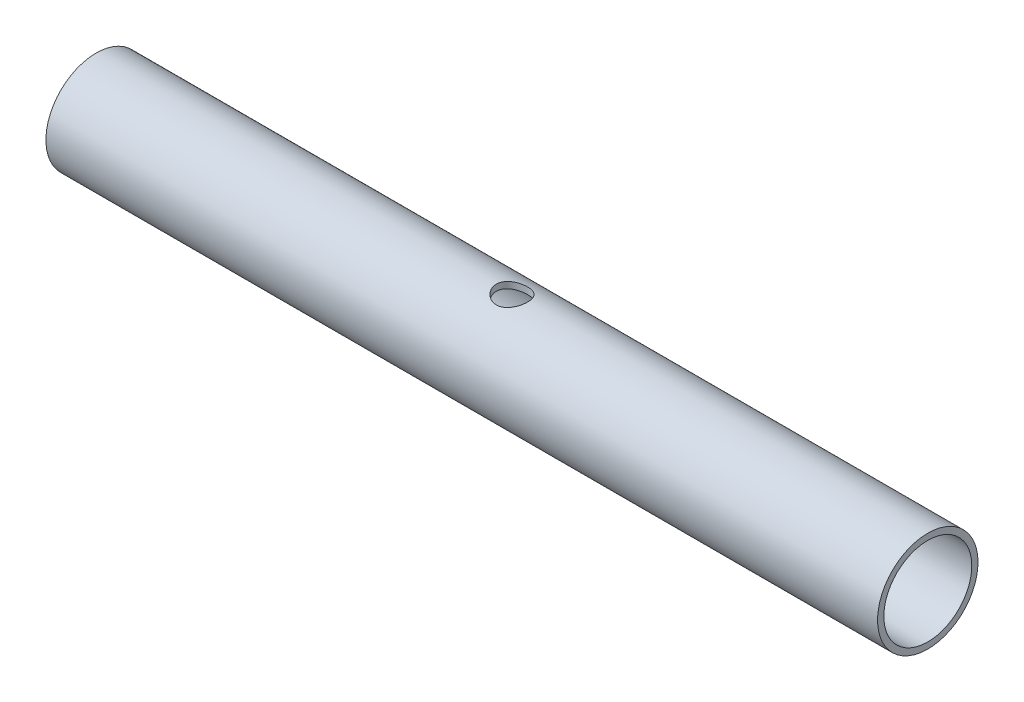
ISO-10303-21;
HEADER;
FILE_DESCRIPTION(('STEP AP214'),'2;1');
FILE_NAME('part.step','',(''),(''),'','','');
FILE_SCHEMA(('AUTOMOTIVE_DESIGN { 1 0 10303 214 1 1 1 1 }'));
ENDSEC;
DATA;
#1=APPLICATION_CONTEXT('core data for automotive mechanical design processes');
#2=APPLICATION_PROTOCOL_DEFINITION('international standard','automotive_design',2000,#1);
#3=PRODUCT_CONTEXT('',#1,'mechanical');
#4=PRODUCT('Part','Part','',(#3));
#5=PRODUCT_RELATED_PRODUCT_CATEGORY('part','',(#4));
#6=PRODUCT_DEFINITION_FORMATION('','',#4);
#7=PRODUCT_DEFINITION_CONTEXT('part definition',#1,'design');
#8=PRODUCT_DEFINITION('design','',#6,#7);
#9=PRODUCT_DEFINITION_SHAPE('','',#8);
#10=(LENGTH_UNIT() NAMED_UNIT(*) SI_UNIT(.MILLI.,.METRE.));
#11=(NAMED_UNIT(*) PLANE_ANGLE_UNIT() SI_UNIT($,.RADIAN.));
#12=(NAMED_UNIT(*) SI_UNIT($,.STERADIAN.) SOLID_ANGLE_UNIT());
#13=UNCERTAINTY_MEASURE_WITH_UNIT(LENGTH_MEASURE(1.E-05),#10,'distance_accuracy_value','');
#14=(GEOMETRIC_REPRESENTATION_CONTEXT(3) GLOBAL_UNCERTAINTY_ASSIGNED_CONTEXT((#13)) GLOBAL_UNIT_ASSIGNED_CONTEXT((#10,
#11,#12)) REPRESENTATION_CONTEXT('',''));
#15=CARTESIAN_POINT('',(0.,0.,0.));
#16=DIRECTION('',(0.,0.,1.));
#17=DIRECTION('',(1.,0.,0.));
#18=AXIS2_PLACEMENT_3D('',#15,#16,#17);
#19=CARTESIAN_POINT('',(200.,0.,0.));
#20=DIRECTION('',(-1.,0.,0.));
#21=DIRECTION('',(0.,0.,1.));
#22=AXIS2_PLACEMENT_3D('',#19,#20,#21);
#23=CYLINDRICAL_SURFACE('',#22,21.15);
#24=CARTESIAN_POINT('',(-200.,0.,0.));
#25=DIRECTION('',(1.,0.,0.));
#26=DIRECTION('',(0.,0.,-1.));
#27=AXIS2_PLACEMENT_3D('',#24,#25,#26);
#28=CIRCLE('',#27,21.15);
#29=CARTESIAN_POINT('',(-200.,0.,-21.15));
#30=VERTEX_POINT('',#29);
#31=EDGE_CURVE('E58',#30,#30,#28,.T.);
#32=ORIENTED_EDGE('',*,*,#31,.F.);
#33=EDGE_LOOP('',(#32));
#34=FACE_BOUND('',#33,.T.);
#35=CARTESIAN_POINT('',(200.,0.,0.));
#36=DIRECTION('',(1.,0.,0.));
#37=DIRECTION('',(0.,0.,-1.));
#38=AXIS2_PLACEMENT_3D('',#35,#36,#37);
#39=CIRCLE('',#38,21.15);
#40=CARTESIAN_POINT('',(200.,0.,-21.15));
#41=VERTEX_POINT('',#40);
#42=EDGE_CURVE('E49',#41,#41,#39,.T.);
#43=ORIENTED_EDGE('',*,*,#42,.T.);
#44=EDGE_LOOP('',(#43));
#45=FACE_BOUND('',#44,.T.);
#46=CARTESIAN_POINT('',(0.,19.7755530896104,-7.5));
#47=CARTESIAN_POINT('',(-0.203351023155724,19.7755526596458,-7.50000050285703));
#48=CARTESIAN_POINT('',(-0.406694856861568,19.7786981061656,-7.49172291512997));
#49=CARTESIAN_POINT('',(-0.811924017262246,19.7911772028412,-7.45869407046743));
#50=CARTESIAN_POINT('',(-1.01380879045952,19.8005130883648,-7.43393686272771));
#51=CARTESIAN_POINT('',(-1.41447791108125,19.825066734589,-7.36820567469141));
#52=CARTESIAN_POINT('',(-1.61326332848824,19.8402824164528,-7.32723742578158));
#53=CARTESIAN_POINT('',(-2.00647861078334,19.8761188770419,-7.22946097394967));
#54=CARTESIAN_POINT('',(-2.20090673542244,19.8967417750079,-7.17264655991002));
#55=CARTESIAN_POINT('',(-2.58352752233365,19.9426961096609,-7.04386458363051));
#56=CARTESIAN_POINT('',(-2.77173506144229,19.9680151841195,-6.97193674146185));
#57=CARTESIAN_POINT('',(-3.1413324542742,20.0226633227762,-6.81340447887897));
#58=CARTESIAN_POINT('',(-3.32271987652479,20.0519938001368,-6.72679488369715));
#59=CARTESIAN_POINT('',(-3.67754439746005,20.1138337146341,-6.53956483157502));
#60=CARTESIAN_POINT('',(-3.85098136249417,20.1463432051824,-6.43894413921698));
#61=CARTESIAN_POINT('',(-4.18893830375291,20.2136655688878,-6.22437658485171));
#62=CARTESIAN_POINT('',(-4.35345787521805,20.2484785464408,-6.11042911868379));
#63=CARTESIAN_POINT('',(-4.67914685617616,20.3209423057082,-5.86505070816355));
#64=CARTESIAN_POINT('',(-4.83991108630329,20.3586509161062,-5.73309876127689));
#65=CARTESIAN_POINT('',(-5.14982171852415,20.4345441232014,-5.45641590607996));
#66=CARTESIAN_POINT('',(-5.29897163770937,20.4727285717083,-5.31168889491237));
#67=CARTESIAN_POINT('',(-5.58489196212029,20.5485888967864,-5.01020594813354));
#68=CARTESIAN_POINT('',(-5.72165575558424,20.5862644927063,-4.85344366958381));
#69=CARTESIAN_POINT('',(-5.98180018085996,20.66007935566,-4.52893977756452));
#70=CARTESIAN_POINT('',(-6.10518571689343,20.6962191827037,-4.36120222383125));
#71=CARTESIAN_POINT('',(-6.34133936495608,20.7670895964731,-4.0104196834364));
#72=CARTESIAN_POINT('',(-6.45366974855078,20.8017437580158,-3.82706410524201));
#73=CARTESIAN_POINT('',(-6.66236949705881,20.8674353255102,-3.45095173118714));
#74=CARTESIAN_POINT('',(-6.75874482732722,20.8984740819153,-3.258198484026));
#75=CARTESIAN_POINT('',(-6.93475564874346,20.9560591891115,-2.86454965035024));
#76=CARTESIAN_POINT('',(-7.01439177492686,20.9826057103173,-2.66365437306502));
#77=CARTESIAN_POINT('',(-7.1561797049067,21.0304291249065,-2.25517718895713));
#78=CARTESIAN_POINT('',(-7.21833236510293,21.0517062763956,-2.04759561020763));
#79=CARTESIAN_POINT('',(-7.32246037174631,21.0876417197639,-1.63553046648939));
#80=CARTESIAN_POINT('',(-7.36512745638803,21.1025255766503,-1.43124126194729));
#81=CARTESIAN_POINT('',(-7.43331640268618,21.126421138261,-1.01948502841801));
#82=CARTESIAN_POINT('',(-7.45883904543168,21.1354331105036,-0.812018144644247));
#83=CARTESIAN_POINT('',(-7.49247440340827,21.1473266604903,-0.395552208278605));
#84=CARTESIAN_POINT('',(-7.50059127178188,21.1502097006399,-0.186553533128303));
#85=CARTESIAN_POINT('',(-7.49934174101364,21.1497665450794,0.231382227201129));
#86=CARTESIAN_POINT('',(-7.48997580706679,21.1464405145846,0.440319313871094));
#87=CARTESIAN_POINT('',(-7.45466689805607,21.1339609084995,0.847213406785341));
#88=CARTESIAN_POINT('',(-7.42948111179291,21.1250735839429,1.0452448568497));
#89=CARTESIAN_POINT('',(-7.3634680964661,21.1019479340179,1.4384326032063));
#90=CARTESIAN_POINT('',(-7.32263570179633,21.0877078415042,1.63358792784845));
#91=CARTESIAN_POINT('',(-7.22571431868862,21.0542485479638,2.01956299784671));
#92=CARTESIAN_POINT('',(-7.16963026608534,21.0350309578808,2.21038412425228));
#93=CARTESIAN_POINT('',(-7.04265517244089,20.992091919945,2.5865881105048));
#94=CARTESIAN_POINT('',(-6.97175853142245,20.9683687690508,2.7719688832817));
#95=CARTESIAN_POINT('',(-6.81467862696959,20.9166625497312,3.13854359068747));
#96=CARTESIAN_POINT('',(-6.72830125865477,20.888626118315,3.31964676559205));
#97=CARTESIAN_POINT('',(-6.54155286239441,20.8292241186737,3.67399117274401));
#98=CARTESIAN_POINT('',(-6.44117705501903,20.7978574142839,3.84722969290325));
#99=CARTESIAN_POINT('',(-6.22714584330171,20.7325700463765,4.18480584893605));
#100=CARTESIAN_POINT('',(-6.11348946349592,20.6986491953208,4.34914282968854));
#101=CARTESIAN_POINT('',(-5.87363078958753,20.6290782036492,4.6680046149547));
#102=CARTESIAN_POINT('',(-5.74742797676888,20.5934279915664,4.82252901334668));
#103=CARTESIAN_POINT('',(-5.4762180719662,20.5193460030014,5.12884681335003));
#104=CARTESIAN_POINT('',(-5.33056863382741,20.4808669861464,5.28006062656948));
#105=CARTESIAN_POINT('',(-5.02715021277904,20.4039998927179,5.56971634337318));
#106=CARTESIAN_POINT('',(-4.86938496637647,20.3656117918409,5.70816215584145));
#107=CARTESIAN_POINT('',(-4.54254683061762,20.2899469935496,5.9715441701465));
#108=CARTESIAN_POINT('',(-4.37346755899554,20.2526709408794,6.0964726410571));
#109=CARTESIAN_POINT('',(-4.02515994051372,20.1803223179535,6.33184406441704));
#110=CARTESIAN_POINT('',(-3.84593559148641,20.1452488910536,6.44229266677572));
#111=CARTESIAN_POINT('',(-3.47496735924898,20.0776998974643,6.64985746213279));
#112=CARTESIAN_POINT('',(-3.28305330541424,20.0452843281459,6.74668950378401));
#113=CARTESIAN_POINT('',(-2.89111525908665,19.9848338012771,6.92370341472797));
#114=CARTESIAN_POINT('',(-2.69109450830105,19.9567971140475,7.0038918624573));
#115=CARTESIAN_POINT('',(-2.2843225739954,19.9060273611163,7.14691111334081));
#116=CARTESIAN_POINT('',(-2.07757269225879,19.8832932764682,7.20974525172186));
#117=CARTESIAN_POINT('',(-1.6588761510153,19.8439146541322,7.31743444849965));
#118=CARTESIAN_POINT('',(-1.4469298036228,19.8272697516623,7.36229058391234));
#119=CARTESIAN_POINT('',(-1.03028839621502,19.8013372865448,7.43174565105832));
#120=CARTESIAN_POINT('',(-0.82576423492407,19.7917220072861,7.45724935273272));
#121=CARTESIAN_POINT('',(-0.415114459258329,19.7788450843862,7.49133653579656));
#122=CARTESIAN_POINT('',(-0.208988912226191,19.775583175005,7.4999207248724));
#123=CARTESIAN_POINT('',(0.203229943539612,19.775523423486,7.50007816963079));
#124=CARTESIAN_POINT('',(0.409323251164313,19.7787243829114,7.49165457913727));
#125=CARTESIAN_POINT('',(0.819917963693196,19.7914794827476,7.45789277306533));
#126=CARTESIAN_POINT('',(1.02441939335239,19.8010335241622,7.43255482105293));
#127=CARTESIAN_POINT('',(1.42197025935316,19.8256589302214,7.36660893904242));
#128=CARTESIAN_POINT('',(1.61514593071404,19.8404885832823,7.32666813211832));
#129=CARTESIAN_POINT('',(1.99738265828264,19.8752559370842,7.23182207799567));
#130=CARTESIAN_POINT('',(2.18644233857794,19.8951953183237,7.17691190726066));
#131=CARTESIAN_POINT('',(2.5591422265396,19.9395956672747,7.05261468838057));
#132=CARTESIAN_POINT('',(2.74278358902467,19.9640556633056,6.98323075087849));
#133=CARTESIAN_POINT('',(3.10366550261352,20.0168268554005,6.83049550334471));
#134=CARTESIAN_POINT('',(3.28090358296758,20.0451395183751,6.74713887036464));
#135=CARTESIAN_POINT('',(3.6338816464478,20.1058781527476,6.56397642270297));
#136=CARTESIAN_POINT('',(3.80936078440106,20.1384120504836,6.46370373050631));
#137=CARTESIAN_POINT('',(4.15138775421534,20.2059000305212,6.24953671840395));
#138=CARTESIAN_POINT('',(4.31793248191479,20.2408549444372,6.13563770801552));
#139=CARTESIAN_POINT('',(4.64112818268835,20.3122555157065,5.8949579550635));
#140=CARTESIAN_POINT('',(4.79777795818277,20.3487013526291,5.76817565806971));
#141=CARTESIAN_POINT('',(5.1003034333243,20.4221462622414,5.50249356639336));
#142=CARTESIAN_POINT('',(5.24617883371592,20.4591453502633,5.36359343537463));
#143=CARTESIAN_POINT('',(5.53416376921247,20.5348265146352,5.06637968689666));
#144=CARTESIAN_POINT('',(5.67560805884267,20.5734871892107,4.90741510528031));
#145=CARTESIAN_POINT('',(5.94459327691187,20.6493108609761,4.57788514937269));
#146=CARTESIAN_POINT('',(6.07213877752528,20.6864743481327,4.40732362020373));
#147=CARTESIAN_POINT('',(6.31253129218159,20.7583088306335,4.05553330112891));
#148=CARTESIAN_POINT('',(6.42537242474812,20.7929788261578,3.87430028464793));
#149=CARTESIAN_POINT('',(6.63538380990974,20.8588320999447,3.50246367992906));
#150=CARTESIAN_POINT('',(6.73256069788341,20.8900168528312,3.31186410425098));
#151=CARTESIAN_POINT('',(6.91005198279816,20.947895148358,2.92344826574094));
#152=CARTESIAN_POINT('',(6.9904461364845,20.9746098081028,2.72567163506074));
#153=CARTESIAN_POINT('',(7.13420663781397,21.0229593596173,2.32350493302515));
#154=CARTESIAN_POINT('',(7.19757989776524,21.0445963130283,2.11911758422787));
#155=CARTESIAN_POINT('',(7.3067142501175,21.082171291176,1.70520605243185));
#156=CARTESIAN_POINT('',(7.35247777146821,21.0981101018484,1.49568258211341));
#157=CARTESIAN_POINT('',(7.42592723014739,21.123818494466,1.07311978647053));
#158=CARTESIAN_POINT('',(7.45361407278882,21.1335883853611,0.860080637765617));
#159=CARTESIAN_POINT('',(7.48963804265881,21.1463215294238,0.443508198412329));
#160=CARTESIAN_POINT('',(7.49891858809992,21.1496165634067,0.240066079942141));
#161=CARTESIAN_POINT('',(7.50090300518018,21.1503201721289,-0.16690755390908));
#162=CARTESIAN_POINT('',(7.49360728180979,21.1477288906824,-0.370439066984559));
#163=CARTESIAN_POINT('',(7.46251357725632,21.1367310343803,-0.776055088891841));
#164=CARTESIAN_POINT('',(7.43871730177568,21.1283250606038,-0.978139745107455));
#165=CARTESIAN_POINT('',(7.37485690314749,21.1059262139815,-1.37940543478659));
#166=CARTESIAN_POINT('',(7.33479276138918,21.0919333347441,-1.57858646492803));
#167=CARTESIAN_POINT('',(7.23974284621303,21.059070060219,-1.96865590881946));
#168=CARTESIAN_POINT('',(7.18507420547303,21.0403036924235,-2.15963054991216));
#169=CARTESIAN_POINT('',(7.06093085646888,20.9982341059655,-2.53625486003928));
#170=CARTESIAN_POINT('',(6.99145121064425,20.9749293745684,-2.72190272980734));
#171=CARTESIAN_POINT('',(6.83826088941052,20.9243658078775,-3.08663092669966));
#172=CARTESIAN_POINT('',(6.75455332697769,20.8971078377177,-3.26571268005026));
#173=CARTESIAN_POINT('',(6.5735176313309,20.8392968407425,-3.61633095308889));
#174=CARTESIAN_POINT('',(6.47618424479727,20.8087425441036,-3.78786452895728));
#175=CARTESIAN_POINT('',(6.15654777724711,20.7107035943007,-4.30280325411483));
#176=CARTESIAN_POINT('',(5.91258802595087,20.6388979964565,-4.63226362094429));
#177=CARTESIAN_POINT('',(5.37482738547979,20.4913311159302,-5.24671676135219));
#178=CARTESIAN_POINT('',(5.08100957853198,20.4155684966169,-5.53169437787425));
#179=CARTESIAN_POINT('',(4.6010915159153,20.3031231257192,-5.92668980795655));
#180=CARTESIAN_POINT('',(4.43037593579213,20.265020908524,-6.05537110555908));
#181=CARTESIAN_POINT('',(4.07828989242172,20.1909723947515,-6.29787162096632));
#182=CARTESIAN_POINT('',(3.89692345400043,20.1550252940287,-6.41169640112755));
#183=CARTESIAN_POINT('',(3.52458977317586,20.0863571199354,-6.62368397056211));
#184=CARTESIAN_POINT('',(3.33361898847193,20.0536372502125,-6.72184092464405));
#185=CARTESIAN_POINT('',(2.94347011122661,19.9924842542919,-6.90160036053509));
#186=CARTESIAN_POINT('',(2.74429567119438,19.9640492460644,-6.98321011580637));
#187=CARTESIAN_POINT('',(2.3392652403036,19.9124173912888,-7.12910395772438));
#188=CARTESIAN_POINT('',(2.13341626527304,19.889215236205,-7.19340561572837));
#189=CARTESIAN_POINT('',(1.71638254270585,19.8488137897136,-7.30414759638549));
#190=CARTESIAN_POINT('',(1.50519777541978,19.8316145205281,-7.3505878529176));
#191=CARTESIAN_POINT('',(1.07926526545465,19.8038424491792,-7.42508643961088));
#192=CARTESIAN_POINT('',(0.864519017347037,19.7932669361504,-7.45315228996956));
#193=CARTESIAN_POINT('',(0.433179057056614,19.7791226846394,-7.49060827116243));
#194=CARTESIAN_POINT('',(0.216585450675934,19.7755535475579,-7.49999946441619));
#195=CARTESIAN_POINT('',(0.,19.7755530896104,-7.5));
#196=B_SPLINE_CURVE_WITH_KNOTS('',3,(#46,#47,#48,#49,#50,#51,#52,#53,#54,#55,#56,#57,#58,#59,
#60,#61,#62,#63,#64,#65,#66,#67,#68,#69,#70,#71,#72,#73,#74,#75,#76,#77,#78,#79,#80,#81,#82,#83,
#84,#85,#86,#87,#88,#89,#90,#91,#92,#93,#94,#95,#96,#97,#98,#99,#100,#101,#102,#103,#104,#105,
#106,#107,#108,#109,#110,#111,#112,#113,#114,#115,#116,#117,#118,#119,#120,#121,#122,#123,#124,
#125,#126,#127,#128,#129,#130,#131,#132,#133,#134,#135,#136,#137,#138,#139,#140,#141,#142,#143,
#144,#145,#146,#147,#148,#149,#150,#151,#152,#153,#154,#155,#156,#157,#158,#159,#160,#161,#162,
#163,#164,#165,#166,#167,#168,#169,#170,#171,#172,#173,#174,#175,#176,#177,#178,#179,#180,#181,
#182,#183,#184,#185,#186,#187,#188,#189,#190,#191,#192,#193,#194,#195),.UNSPECIFIED.,.T.,.F.,(4,
2,2,2,2,2,2,2,2,2,2,2,2,2,2,2,2,2,2,2,2,2,2,2,2,2,2,2,2,2,2,2,2,2,2,2,2,2,2,2,2,2,2,2,2,2,2,2,2,
2,2,2,2,2,2,2,2,2,2,2,2,2,2,2,2,2,2,2,2,2,2,2,2,2,4),(0.,0.609849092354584,1.21991852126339,
1.82977245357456,2.43986576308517,3.04837528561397,3.65709973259,4.26583440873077,
4.87459669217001,5.5080008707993,6.14121248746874,6.77476014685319,7.40807476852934,
8.06067467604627,8.71303003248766,9.36536063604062,10.0176592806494,10.6445456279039,
11.2714034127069,11.8981116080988,12.5248031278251,13.1235721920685,13.7225391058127,
14.3213124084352,14.920312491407,15.5274284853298,16.1347522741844,16.7421206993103,
17.3495142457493,17.9891246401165,18.6285385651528,19.2683162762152,19.9078436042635,
20.5591911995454,21.2102808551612,21.8612452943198,22.5121707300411,23.1303826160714,
23.7485686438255,24.3666400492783,24.984701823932,25.5774779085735,26.1704491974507,
26.7632931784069,27.3563635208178,27.9698170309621,28.5834823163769,29.1972217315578,
29.8109781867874,30.4590100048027,31.1068279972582,31.7549043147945,32.4027053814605,
33.0473540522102,33.6917405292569,34.3360380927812,34.9803033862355,35.5905930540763,
36.2008678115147,36.8110794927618,37.4212918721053,38.019201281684,38.6173103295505,
39.2152886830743,39.8134982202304,41.0562327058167,42.2993897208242,42.9501817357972,
43.6007293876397,44.2515187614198,44.9020214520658,45.5518612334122,46.2017034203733,
46.8512794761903,47.5008185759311),.UNSPECIFIED.);
#197=CARTESIAN_POINT('',(0.,19.7755530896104,-7.5));
#198=VERTEX_POINT('',#197);
#199=EDGE_CURVE('E61',#198,#198,#196,.T.);
#200=ORIENTED_EDGE('',*,*,#199,.T.);
#201=EDGE_LOOP('',(#200));
#202=FACE_BOUND('',#201,.T.);
#203=ADVANCED_FACE('F35',(#34,#45,#202),#23,.F.);
#204=CARTESIAN_POINT('',(200.,0.,0.));
#205=DIRECTION('',(-1.,0.,0.));
#206=DIRECTION('',(0.,0.,1.));
#207=AXIS2_PLACEMENT_3D('',#204,#205,#206);
#208=CYLINDRICAL_SURFACE('',#207,24.15);
#209=CARTESIAN_POINT('',(200.,0.,0.));
#210=DIRECTION('',(1.,0.,0.));
#211=DIRECTION('',(0.,0.,-1.));
#212=AXIS2_PLACEMENT_3D('',#209,#210,#211);
#213=CIRCLE('',#212,24.15);
#214=CARTESIAN_POINT('',(200.,0.,-24.15));
#215=VERTEX_POINT('',#214);
#216=EDGE_CURVE('E45',#215,#215,#213,.T.);
#217=ORIENTED_EDGE('',*,*,#216,.F.);
#218=EDGE_LOOP('',(#217));
#219=FACE_BOUND('',#218,.T.);
#220=CARTESIAN_POINT('',(-200.,0.,0.));
#221=DIRECTION('',(1.,0.,0.));
#222=DIRECTION('',(0.,0.,-1.));
#223=AXIS2_PLACEMENT_3D('',#220,#221,#222);
#224=CIRCLE('',#223,24.15);
#225=CARTESIAN_POINT('',(-200.,0.,-24.15));
#226=VERTEX_POINT('',#225);
#227=EDGE_CURVE('E53',#226,#226,#224,.T.);
#228=ORIENTED_EDGE('',*,*,#227,.T.);
#229=EDGE_LOOP('',(#228));
#230=FACE_BOUND('',#229,.T.);
#231=CARTESIAN_POINT('',(-7.5,24.15,0.));
#232=CARTESIAN_POINT('',(-7.49999972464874,24.1499998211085,0.205386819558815));
#233=CARTESIAN_POINT('',(-7.49155631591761,24.1473737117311,0.410778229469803));
#234=CARTESIAN_POINT('',(-7.45786072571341,24.1369412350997,0.820046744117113));
#235=CARTESIAN_POINT('',(-7.432608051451,24.1291347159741,1.02392380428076));
#236=CARTESIAN_POINT('',(-7.36552495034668,24.1085553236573,1.42867882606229));
#237=CARTESIAN_POINT('',(-7.32369428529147,24.0957823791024,1.6295567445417));
#238=CARTESIAN_POINT('',(-7.223811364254,24.0656121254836,2.02695517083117));
#239=CARTESIAN_POINT('',(-7.16575310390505,24.0482131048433,2.2234740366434));
#240=CARTESIAN_POINT('',(-7.03403471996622,24.0092938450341,2.61036770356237));
#241=CARTESIAN_POINT('',(-6.96040516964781,23.9877816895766,2.80075371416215));
#242=CARTESIAN_POINT('',(-6.79806841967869,23.9411823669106,3.17456255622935));
#243=CARTESIAN_POINT('',(-6.70935554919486,23.9160938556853,3.35798273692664));
#244=CARTESIAN_POINT('',(-6.42161158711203,23.8364309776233,3.89589564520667));
#245=CARTESIAN_POINT('',(-6.20085564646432,23.7774224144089,4.23838958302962));
#246=CARTESIAN_POINT('',(-5.700703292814,23.6518626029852,4.89139797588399));
#247=CARTESIAN_POINT('',(-5.41986020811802,23.5851484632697,5.20077288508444));
#248=CARTESIAN_POINT('',(-4.96327183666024,23.4858349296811,5.62667088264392));
#249=CARTESIAN_POINT('',(-4.80508122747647,23.4528368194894,5.76234718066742));
#250=CARTESIAN_POINT('',(-4.47783788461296,23.3879849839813,6.0201573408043));
#251=CARTESIAN_POINT('',(-4.30878920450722,23.356130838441,6.14229621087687));
#252=CARTESIAN_POINT('',(-3.95653297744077,23.2936873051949,6.37507079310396));
#253=CARTESIAN_POINT('',(-3.77307817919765,23.2631489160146,6.48534585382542));
#254=CARTESIAN_POINT('',(-3.39710169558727,23.2051357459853,6.6899537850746));
#255=CARTESIAN_POINT('',(-3.20458337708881,23.1776598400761,6.7842925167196));
#256=CARTESIAN_POINT('',(-2.81173541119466,23.12661741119,6.9563009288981));
#257=CARTESIAN_POINT('',(-2.61140582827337,23.1030508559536,7.03397074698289));
#258=CARTESIAN_POINT('',(-2.20437386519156,23.0605899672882,7.17195287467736));
#259=CARTESIAN_POINT('',(-1.99767173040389,23.041695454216,7.23226585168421));
#260=CARTESIAN_POINT('',(-1.58567803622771,23.0096927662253,7.33343514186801));
#261=CARTESIAN_POINT('',(-1.38052760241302,22.9964291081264,7.37481712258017));
#262=CARTESIAN_POINT('',(-0.967215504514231,22.9753219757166,7.44031373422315));
#263=CARTESIAN_POINT('',(-0.759053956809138,22.967478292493,7.46442903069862));
#264=CARTESIAN_POINT('',(-0.341351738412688,22.9574701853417,7.49515342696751));
#265=CARTESIAN_POINT('',(-0.131811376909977,22.9553045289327,7.50176632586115));
#266=CARTESIAN_POINT('',(0.287065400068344,22.9567211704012,7.49743019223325));
#267=CARTESIAN_POINT('',(0.496401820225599,22.9603033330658,7.4864815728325));
#268=CARTESIAN_POINT('',(0.90506908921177,22.9728443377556,7.44790647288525));
#269=CARTESIAN_POINT('',(1.10447036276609,22.9815868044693,7.42095091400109));
#270=CARTESIAN_POINT('',(1.50026067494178,23.0040046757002,7.35116390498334));
#271=CARTESIAN_POINT('',(1.69664868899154,23.0176817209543,7.30832717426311));
#272=CARTESIAN_POINT('',(2.08495255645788,23.0495572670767,7.20716427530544));
#273=CARTESIAN_POINT('',(2.27686967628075,23.0677544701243,7.14884255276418));
#274=CARTESIAN_POINT('',(2.65511396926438,23.1081533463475,7.0171567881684));
#275=CARTESIAN_POINT('',(2.84143899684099,23.1303565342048,6.94378705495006));
#276=CARTESIAN_POINT('',(3.20984542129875,23.1784767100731,6.7814439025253));
#277=CARTESIAN_POINT('',(3.39183008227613,23.2044416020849,6.69226526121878));
#278=CARTESIAN_POINT('',(3.74773312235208,23.259128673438,6.49965034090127));
#279=CARTESIAN_POINT('',(3.92164871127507,23.2878517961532,6.39620917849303));
#280=CARTESIAN_POINT('',(4.2603314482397,23.3472722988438,6.17579148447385));
#281=CARTESIAN_POINT('',(4.42509820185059,23.3779697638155,6.0588143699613));
#282=CARTESIAN_POINT('',(4.74452767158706,23.4405312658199,5.81207276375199));
#283=CARTESIAN_POINT('',(4.89919007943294,23.4723953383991,5.68230788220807));
#284=CARTESIAN_POINT('',(5.20425680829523,23.5379183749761,5.40464136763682));
#285=CARTESIAN_POINT('',(5.35415361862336,23.5715934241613,5.25618539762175));
#286=CARTESIAN_POINT('',(5.6409227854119,23.6383812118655,4.94716184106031));
#287=CARTESIAN_POINT('',(5.77779930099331,23.6714941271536,4.78659815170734));
#288=CARTESIAN_POINT('',(6.03772981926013,23.7362766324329,4.45424984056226));
#289=CARTESIAN_POINT('',(6.16077755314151,23.7679455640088,4.28246018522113));
#290=CARTESIAN_POINT('',(6.3920625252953,23.8289429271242,3.9288859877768));
#291=CARTESIAN_POINT('',(6.50030558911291,23.8582722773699,3.74710541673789));
#292=CARTESIAN_POINT('',(6.70203214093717,23.9140180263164,3.37316714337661));
#293=CARTESIAN_POINT('',(6.79538959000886,23.9404090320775,3.18093759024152));
#294=CARTESIAN_POINT('',(6.96548005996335,23.9892428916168,2.78885859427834));
#295=CARTESIAN_POINT('',(7.0422194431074,24.011687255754,2.58901210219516));
#296=CARTESIAN_POINT('',(7.17844033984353,24.051990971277,2.18307709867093));
#297=CARTESIAN_POINT('',(7.23792265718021,24.0698505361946,1.97698887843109));
#298=CARTESIAN_POINT('',(7.33907596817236,24.1004607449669,1.5601160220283));
#299=CARTESIAN_POINT('',(7.38074766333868,24.1132115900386,1.34933157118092));
#300=CARTESIAN_POINT('',(7.44462963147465,24.1328432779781,0.932828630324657));
#301=CARTESIAN_POINT('',(7.46752272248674,24.1399298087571,0.727224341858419));
#302=CARTESIAN_POINT('',(7.49624557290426,24.1488303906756,0.314715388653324));
#303=CARTESIAN_POINT('',(7.50207578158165,24.1506445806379,0.107810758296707));
#304=CARTESIAN_POINT('',(7.49661852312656,24.1489499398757,-0.305722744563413));
#305=CARTESIAN_POINT('',(7.48533326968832,24.1454417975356,-0.512351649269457));
#306=CARTESIAN_POINT('',(7.44575585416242,24.1332017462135,-0.923816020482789));
#307=CARTESIAN_POINT('',(7.41746382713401,24.1244698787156,-1.12865150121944));
#308=CARTESIAN_POINT('',(7.34504379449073,24.1023030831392,-1.52999375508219));
#309=CARTESIAN_POINT('',(7.30132459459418,24.0889897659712,-1.72658123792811));
#310=CARTESIAN_POINT('',(7.19831632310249,24.0579684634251,-2.11534708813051));
#311=CARTESIAN_POINT('',(7.13902204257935,24.0402590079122,-2.30752395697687));
#312=CARTESIAN_POINT('',(7.00537049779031,24.0009091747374,-2.68608792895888));
#313=CARTESIAN_POINT('',(6.93101728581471,23.9792698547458,-2.87247657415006));
#314=CARTESIAN_POINT('',(6.76777816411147,23.9325971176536,-3.23841560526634));
#315=CARTESIAN_POINT('',(6.67888677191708,23.907562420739,-3.41796337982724));
#316=CARTESIAN_POINT('',(6.48494476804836,23.8541006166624,-3.77325083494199));
#317=CARTESIAN_POINT('',(6.37955962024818,23.8256068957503,-3.94879787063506));
#318=CARTESIAN_POINT('',(6.15495131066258,23.7664508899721,-4.29050038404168));
#319=CARTESIAN_POINT('',(6.03572336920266,23.7357878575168,-4.4566525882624));
#320=CARTESIAN_POINT('',(5.78423864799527,23.6730879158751,-4.77852461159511));
#321=CARTESIAN_POINT('',(5.65198101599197,23.6410509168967,-4.93424374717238));
#322=CARTESIAN_POINT('',(5.37527150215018,23.5764278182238,-5.23432065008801));
#323=CARTESIAN_POINT('',(5.23081936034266,23.5438417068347,-5.37867817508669));
#324=CARTESIAN_POINT('',(4.92468003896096,23.4776867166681,-5.6606105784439));
#325=CARTESIAN_POINT('',(4.76253840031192,23.4441296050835,-5.79769523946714));
#326=CARTESIAN_POINT('',(4.42711289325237,23.3782976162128,-6.05769632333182));
#327=CARTESIAN_POINT('',(4.25383279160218,23.3460223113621,-6.18061749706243));
#328=CARTESIAN_POINT('',(3.89711418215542,23.2836671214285,-6.41152542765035));
#329=CARTESIAN_POINT('',(3.71367173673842,23.2535880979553,-6.51950633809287));
#330=CARTESIAN_POINT('',(3.33796513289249,23.1965527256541,-6.71961815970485));
#331=CARTESIAN_POINT('',(3.14570465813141,23.1695950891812,-6.81175561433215));
#332=CARTESIAN_POINT('',(2.75430427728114,23.1197136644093,-6.97917963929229));
#333=CARTESIAN_POINT('',(2.55519174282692,23.0967756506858,-7.05452590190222));
#334=CARTESIAN_POINT('',(2.15091957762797,23.0555534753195,-7.18810434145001));
#335=CARTESIAN_POINT('',(1.94576238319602,23.0372674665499,-7.24634331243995));
#336=CARTESIAN_POINT('',(1.53087221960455,23.0059403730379,-7.34519573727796));
#337=CARTESIAN_POINT('',(1.32113977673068,22.9928986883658,-7.38581120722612));
#338=CARTESIAN_POINT('',(0.898705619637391,22.9724982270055,-7.44902234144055));
#339=CARTESIAN_POINT('',(0.686004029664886,22.9651392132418,-7.47161875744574));
#340=CARTESIAN_POINT('',(0.268873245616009,22.9565517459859,-7.49796040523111));
#341=CARTESIAN_POINT('',(0.0644993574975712,22.9550639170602,-7.50250326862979));
#342=CARTESIAN_POINT('',(-0.343902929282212,22.9575494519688,-7.4948942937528));
#343=CARTESIAN_POINT('',(-0.547931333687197,22.9615227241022,-7.48274273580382));
#344=CARTESIAN_POINT('',(-0.954129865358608,22.9748048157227,-7.44186151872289));
#345=CARTESIAN_POINT('',(-1.15630009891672,22.9841133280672,-7.41313281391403));
#346=CARTESIAN_POINT('',(-1.55733996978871,23.0077755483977,-7.33936384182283));
#347=CARTESIAN_POINT('',(-1.75620959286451,23.0221292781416,-7.29432350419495));
#348=CARTESIAN_POINT('',(-2.14640832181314,23.055201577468,-7.18910088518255));
#349=CARTESIAN_POINT('',(-2.33780496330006,23.0738538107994,-7.12914772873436));
#350=CARTESIAN_POINT('',(-2.71487178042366,23.1151009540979,-6.99425333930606));
#351=CARTESIAN_POINT('',(-2.90054001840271,23.1376971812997,-6.91930709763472));
#352=CARTESIAN_POINT('',(-3.26490186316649,23.1861916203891,-6.75502383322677));
#353=CARTESIAN_POINT('',(-3.44359674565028,23.2120892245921,-6.66568945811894));
#354=CARTESIAN_POINT('',(-3.79305334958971,23.2664983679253,-6.47321823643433));
#355=CARTESIAN_POINT('',(-3.96381220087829,23.2950108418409,-6.37007644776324));
#356=CARTESIAN_POINT('',(-4.30276743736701,23.3550298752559,-6.14646140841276));
#357=CARTESIAN_POINT('',(-4.47061147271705,23.3866094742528,-6.02547342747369));
#358=CARTESIAN_POINT('',(-4.79560678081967,23.4509054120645,-5.77016980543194));
#359=CARTESIAN_POINT('',(-4.95275774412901,23.4836217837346,-5.63585377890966));
#360=CARTESIAN_POINT('',(-5.25547731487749,23.5493247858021,-5.35468474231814));
#361=CARTESIAN_POINT('',(-5.40104108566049,23.5823115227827,-5.20782654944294));
#362=CARTESIAN_POINT('',(-5.6795652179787,23.6476560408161,-4.90257225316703));
#363=CARTESIAN_POINT('',(-5.81252976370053,23.680014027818,-4.74418001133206));
#364=CARTESIAN_POINT('',(-6.06916761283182,23.7442910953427,-4.4114364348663));
#365=CARTESIAN_POINT('',(-6.19239772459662,23.7761616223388,-4.23673348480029));
#366=CARTESIAN_POINT('',(-6.42362694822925,23.8374296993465,-3.87720029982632));
#367=CARTESIAN_POINT('',(-6.53163156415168,23.8668281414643,-3.69237375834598));
#368=CARTESIAN_POINT('',(-6.73160920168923,23.9223291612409,-3.31379812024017));
#369=CARTESIAN_POINT('',(-6.82358449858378,23.9484322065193,-3.12005029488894));
#370=CARTESIAN_POINT('',(-6.99074830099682,23.9965966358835,-2.72496547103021));
#371=CARTESIAN_POINT('',(-7.06593820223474,24.0186583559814,-2.52362910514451));
#372=CARTESIAN_POINT('',(-7.19299297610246,24.0563568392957,-2.13289758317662));
#373=CARTESIAN_POINT('',(-7.24633142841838,24.0723889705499,-1.94401834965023));
#374=CARTESIAN_POINT('',(-7.33810639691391,24.1001740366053,-1.56228644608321));
#375=CARTESIAN_POINT('',(-7.37653770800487,24.1119254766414,-1.36943241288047));
#376=CARTESIAN_POINT('',(-7.43814910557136,24.1308454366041,-0.981111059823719));
#377=CARTESIAN_POINT('',(-7.4613316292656,24.1380146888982,-0.785644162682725));
#378=CARTESIAN_POINT('',(-7.49225425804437,24.1475911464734,-0.393452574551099));
#379=CARTESIAN_POINT('',(-7.50000026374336,24.15000017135,-0.19672839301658));
#380=CARTESIAN_POINT('',(-7.5,24.15,0.));
#381=B_SPLINE_CURVE_WITH_KNOTS('',3,(#231,#232,#233,#234,#235,#236,#237,#238,#239,#240,#241,
#242,#243,#244,#245,#246,#247,#248,#249,#250,#251,#252,#253,#254,#255,#256,#257,#258,#259,#260,
#261,#262,#263,#264,#265,#266,#267,#268,#269,#270,#271,#272,#273,#274,#275,#276,#277,#278,#279,
#280,#281,#282,#283,#284,#285,#286,#287,#288,#289,#290,#291,#292,#293,#294,#295,#296,#297,#298,
#299,#300,#301,#302,#303,#304,#305,#306,#307,#308,#309,#310,#311,#312,#313,#314,#315,#316,#317,
#318,#319,#320,#321,#322,#323,#324,#325,#326,#327,#328,#329,#330,#331,#332,#333,#334,#335,#336,
#337,#338,#339,#340,#341,#342,#343,#344,#345,#346,#347,#348,#349,#350,#351,#352,#353,#354,#355,
#356,#357,#358,#359,#360,#361,#362,#363,#364,#365,#366,#367,#368,#369,#370,#371,#372,#373,#374,
#375,#376,#377,#378,#379,#380),.UNSPECIFIED.,.T.,.F.,(4,2,2,2,2,2,2,2,2,2,2,2,2,2,2,2,2,2,2,2,2,
2,2,2,2,2,2,2,2,2,2,2,2,2,2,2,2,2,2,2,2,2,2,2,2,2,2,2,2,2,2,2,2,2,2,2,2,2,2,2,2,2,2,2,2,2,2,2,2,
2,2,2,2,2,4),(0.,0.615978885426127,1.23197583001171,1.8479816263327,2.46421565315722,
3.0792507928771,3.69451767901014,4.92395325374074,6.18722489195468,6.81963198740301,
7.45180434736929,8.09966368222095,8.74728422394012,9.39489942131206,10.0424897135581,
10.6708055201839,11.299097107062,11.9272523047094,12.5553927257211,13.1588983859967,
13.7626048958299,14.366138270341,14.9699003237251,15.5821663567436,16.1946425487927,
16.8071451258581,17.4196663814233,18.0598421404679,18.6998127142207,19.34007223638,
19.9800790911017,20.6252461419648,21.2701657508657,21.9150553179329,22.5599194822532,
23.1801418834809,23.8003479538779,24.4204738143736,25.0405947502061,25.6453844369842,
26.2503766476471,26.8552062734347,27.4602645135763,28.0797382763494,28.6994265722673,
29.3191554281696,29.9388974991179,30.5830193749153,31.22692455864,31.871081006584,
32.5149707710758,33.156533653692,33.7978413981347,34.4390757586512,35.0802833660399,
35.6928239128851,36.3053541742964,36.9178491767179,37.5303468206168,38.1339596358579,
38.737774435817,39.3414782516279,39.9453987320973,40.5725927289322,41.1998048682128,
41.8272774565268,42.4545409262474,43.1022178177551,43.7496599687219,44.3970101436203,
45.0443064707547,45.634431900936,46.22476319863,46.8150001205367,47.4050113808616),.UNSPECIFIED.);
#382=CARTESIAN_POINT('',(-7.5,24.15,0.));
#383=VERTEX_POINT('',#382);
#384=EDGE_CURVE('E10',#383,#383,#381,.T.);
#385=ORIENTED_EDGE('',*,*,#384,.F.);
#386=EDGE_LOOP('',(#385));
#387=FACE_BOUND('',#386,.T.);
#388=ADVANCED_FACE('F77',(#219,#230,#387),#208,.T.);
#389=CARTESIAN_POINT('',(200.,0.,0.));
#390=DIRECTION('',(1.,0.,0.));
#391=DIRECTION('',(0.,0.,-1.));
#392=AXIS2_PLACEMENT_3D('',#389,#390,#391);
#393=PLANE('',#392);
#394=ORIENTED_EDGE('',*,*,#42,.F.);
#395=EDGE_LOOP('',(#394));
#396=FACE_BOUND('',#395,.T.);
#397=ORIENTED_EDGE('',*,*,#216,.T.);
#398=EDGE_LOOP('',(#397));
#399=FACE_BOUND('',#398,.T.);
#400=ADVANCED_FACE('F74',(#396,#399),#393,.T.);
#401=CARTESIAN_POINT('',(-200.,0.,0.));
#402=DIRECTION('',(1.,0.,0.));
#403=DIRECTION('',(0.,0.,-1.));
#404=AXIS2_PLACEMENT_3D('',#401,#402,#403);
#405=PLANE('',#404);
#406=ORIENTED_EDGE('',*,*,#31,.T.);
#407=EDGE_LOOP('',(#406));
#408=FACE_BOUND('',#407,.T.);
#409=ORIENTED_EDGE('',*,*,#227,.F.);
#410=EDGE_LOOP('',(#409));
#411=FACE_BOUND('',#410,.T.);
#412=ADVANCED_FACE('F69',(#408,#411),#405,.F.);
#413=CARTESIAN_POINT('',(0.,24.15,0.));
#414=DIRECTION('',(0.,-1.,0.));
#415=DIRECTION('',(0.,0.,-1.));
#416=AXIS2_PLACEMENT_3D('',#413,#414,#415);
#417=CYLINDRICAL_SURFACE('',#416,7.5);
#418=ORIENTED_EDGE('',*,*,#199,.F.);
#419=EDGE_LOOP('',(#418));
#420=FACE_BOUND('',#419,.T.);
#421=ORIENTED_EDGE('',*,*,#384,.T.);
#422=EDGE_LOOP('',(#421));
#423=FACE_BOUND('',#422,.T.);
#424=ADVANCED_FACE('F65',(#420,#423),#417,.F.);
#425=CLOSED_SHELL('',(#203,#388,#400,#412,#424));
#426=MANIFOLD_SOLID_BREP('B2',#425);
#427=ADVANCED_BREP_SHAPE_REPRESENTATION('',(#18,#426),#14);
#428=SHAPE_DEFINITION_REPRESENTATION(#9,#427);
ENDSEC;
END-ISO-10303-21;
